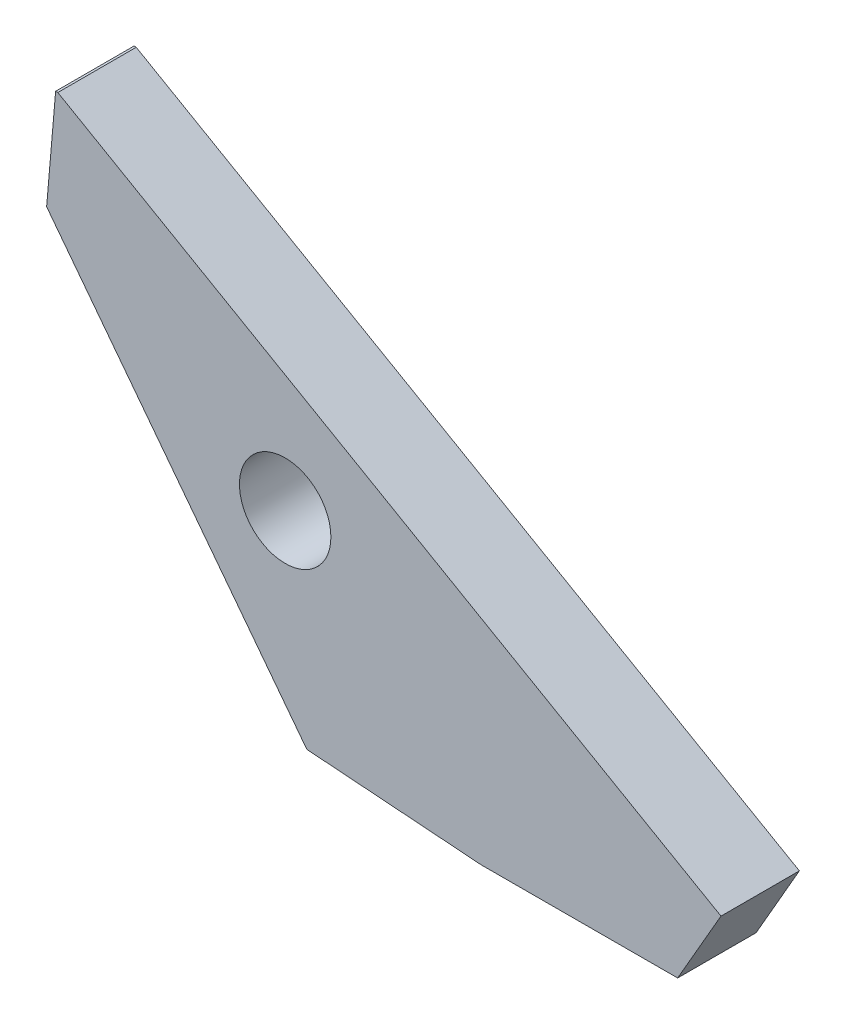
ISO-10303-21;
HEADER;
FILE_DESCRIPTION(('STEP AP214'),'2;1');
FILE_NAME('part.step','',(''),(''),'','','');
FILE_SCHEMA(('AUTOMOTIVE_DESIGN { 1 0 10303 214 1 1 1 1 }'));
ENDSEC;
DATA;
#1=APPLICATION_CONTEXT('core data for automotive mechanical design processes');
#2=APPLICATION_PROTOCOL_DEFINITION('international standard','automotive_design',2000,#1);
#3=PRODUCT_CONTEXT('',#1,'mechanical');
#4=PRODUCT('Part','Part','',(#3));
#5=PRODUCT_RELATED_PRODUCT_CATEGORY('part','',(#4));
#6=PRODUCT_DEFINITION_FORMATION('','',#4);
#7=PRODUCT_DEFINITION_CONTEXT('part definition',#1,'design');
#8=PRODUCT_DEFINITION('design','',#6,#7);
#9=PRODUCT_DEFINITION_SHAPE('','',#8);
#10=(LENGTH_UNIT() NAMED_UNIT(*) SI_UNIT(.MILLI.,.METRE.));
#11=(NAMED_UNIT(*) PLANE_ANGLE_UNIT() SI_UNIT($,.RADIAN.));
#12=(NAMED_UNIT(*) SI_UNIT($,.STERADIAN.) SOLID_ANGLE_UNIT());
#13=UNCERTAINTY_MEASURE_WITH_UNIT(LENGTH_MEASURE(1.E-05),#10,'distance_accuracy_value','');
#14=(GEOMETRIC_REPRESENTATION_CONTEXT(3) GLOBAL_UNCERTAINTY_ASSIGNED_CONTEXT((#13)) GLOBAL_UNIT_ASSIGNED_CONTEXT((#10,
#11,#12)) REPRESENTATION_CONTEXT('',''));
#15=CARTESIAN_POINT('',(0.,0.,0.));
#16=DIRECTION('',(0.,0.,1.));
#17=DIRECTION('',(1.,0.,0.));
#18=AXIS2_PLACEMENT_3D('',#15,#16,#17);
#19=CARTESIAN_POINT('',(-87.8467703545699,95.0748547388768,30.));
#20=DIRECTION('',(0.,0.,1.));
#21=DIRECTION('',(1.,0.,0.));
#22=AXIS2_PLACEMENT_3D('',#19,#20,#21);
#23=PLANE('',#22);
#24=DIRECTION('',(-1.,0.,0.));
#25=VECTOR('',#24,1.);
#26=CARTESIAN_POINT('',(-87.8467703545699,95.0748547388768,30.));
#27=LINE('',#26,#25);
#28=CARTESIAN_POINT('',(-87.0060329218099,95.0748547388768,30.));
#29=VERTEX_POINT('',#28);
#30=CARTESIAN_POINT('',(-87.8467703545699,95.0748547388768,30.));
#31=VERTEX_POINT('',#30);
#32=EDGE_CURVE('E135',#29,#31,#27,.T.);
#33=ORIENTED_EDGE('',*,*,#32,.T.);
#34=DIRECTION('',(-0.0858114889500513,-0.996311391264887,0.));
#35=VECTOR('',#34,1.);
#36=CARTESIAN_POINT('',(-90.,70.0748547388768,30.));
#37=LINE('',#36,#35);
#38=CARTESIAN_POINT('',(-91.2919377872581,55.0748547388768,30.));
#39=VERTEX_POINT('',#38);
#40=EDGE_CURVE('E88',#31,#39,#37,.T.);
#41=ORIENTED_EDGE('',*,*,#40,.T.);
#42=DIRECTION('',(0.607956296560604,-0.7939704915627,0.));
#43=VECTOR('',#42,1.);
#44=CARTESIAN_POINT('',(-91.2919377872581,55.0748547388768,30.));
#45=LINE('',#44,#43);
#46=CARTESIAN_POINT('',(8.30000000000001,-74.9888689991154,30.));
#47=VERTEX_POINT('',#46);
#48=EDGE_CURVE('E147',#39,#47,#45,.T.);
#49=ORIENTED_EDGE('',*,*,#48,.T.);
#50=DIRECTION('',(0.997301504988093,-0.0734146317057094,0.));
#51=VECTOR('',#50,1.);
#52=CARTESIAN_POINT('',(8.30000000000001,-74.9888689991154,30.));
#53=LINE('',#52,#51);
#54=CARTESIAN_POINT('',(75.,-79.898874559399,30.));
#55=VERTEX_POINT('',#54);
#56=EDGE_CURVE('E104',#47,#55,#53,.T.);
#57=ORIENTED_EDGE('',*,*,#56,.T.);
#58=DIRECTION('',(0.999999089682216,0.0013493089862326,0.));
#59=VECTOR('',#58,1.);
#60=CARTESIAN_POINT('',(150.218878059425,-79.7973809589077,30.));
#61=LINE('',#60,#59);
#62=CARTESIAN_POINT('',(150.218878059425,-79.7973809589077,30.));
#63=VERTEX_POINT('',#62);
#64=EDGE_CURVE('E98',#55,#63,#61,.T.);
#65=ORIENTED_EDGE('',*,*,#64,.T.);
#66=DIRECTION('',(0.498831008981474,0.866699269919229,0.));
#67=VECTOR('',#66,1.);
#68=CARTESIAN_POINT('',(166.793285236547,-51.,30.));
#69=LINE('',#68,#67);
#70=CARTESIAN_POINT('',(166.793285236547,-51.,30.));
#71=VERTEX_POINT('',#70);
#72=EDGE_CURVE('E102',#63,#71,#69,.T.);
#73=ORIENTED_EDGE('',*,*,#72,.T.);
#74=DIRECTION('',(-0.866699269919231,0.49883100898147,0.));
#75=VECTOR('',#74,1.);
#76=CARTESIAN_POINT('',(-87.0060329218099,95.0748547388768,30.));
#77=LINE('',#76,#75);
#78=EDGE_CURVE('E48',#71,#29,#77,.T.);
#79=ORIENTED_EDGE('',*,*,#78,.T.);
#80=EDGE_LOOP('',(#33,#41,#49,#57,#65,#73,#79));
#81=FACE_BOUND('',#80,.T.);
#82=CARTESIAN_POINT('',(0.,0.,30.));
#83=DIRECTION('',(0.,0.,1.));
#84=DIRECTION('',(1.,0.,0.));
#85=AXIS2_PLACEMENT_3D('',#82,#83,#84);
#86=CIRCLE('',#85,17.5);
#87=CARTESIAN_POINT('',(17.5,0.,30.));
#88=VERTEX_POINT('',#87);
#89=EDGE_CURVE('E126',#88,#88,#86,.T.);
#90=ORIENTED_EDGE('',*,*,#89,.F.);
#91=EDGE_LOOP('',(#90));
#92=FACE_BOUND('',#91,.T.);
#93=ADVANCED_FACE('F31',(#81,#92),#23,.T.);
#94=CARTESIAN_POINT('',(-87.8467703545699,95.0748547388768,0.));
#95=DIRECTION('',(0.,0.,1.));
#96=DIRECTION('',(1.,0.,0.));
#97=AXIS2_PLACEMENT_3D('',#94,#95,#96);
#98=PLANE('',#97);
#99=DIRECTION('',(-1.,0.,0.));
#100=VECTOR('',#99,1.);
#101=CARTESIAN_POINT('',(-87.8467703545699,95.0748547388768,0.));
#102=LINE('',#101,#100);
#103=CARTESIAN_POINT('',(-87.0060329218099,95.0748547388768,0.));
#104=VERTEX_POINT('',#103);
#105=CARTESIAN_POINT('',(-87.8467703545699,95.0748547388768,0.));
#106=VERTEX_POINT('',#105);
#107=EDGE_CURVE('E122',#104,#106,#102,.T.);
#108=ORIENTED_EDGE('',*,*,#107,.F.);
#109=DIRECTION('',(-0.866699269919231,0.49883100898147,0.));
#110=VECTOR('',#109,1.);
#111=CARTESIAN_POINT('',(-87.0060329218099,95.0748547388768,0.));
#112=LINE('',#111,#110);
#113=CARTESIAN_POINT('',(166.793285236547,-51.,0.));
#114=VERTEX_POINT('',#113);
#115=EDGE_CURVE('E80',#114,#104,#112,.T.);
#116=ORIENTED_EDGE('',*,*,#115,.F.);
#117=DIRECTION('',(0.498831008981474,0.866699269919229,0.));
#118=VECTOR('',#117,1.);
#119=CARTESIAN_POINT('',(166.793285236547,-51.,0.));
#120=LINE('',#119,#118);
#121=CARTESIAN_POINT('',(150.218878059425,-79.7973809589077,0.));
#122=VERTEX_POINT('',#121);
#123=EDGE_CURVE('E74',#122,#114,#120,.T.);
#124=ORIENTED_EDGE('',*,*,#123,.F.);
#125=DIRECTION('',(0.999999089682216,0.0013493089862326,0.));
#126=VECTOR('',#125,1.);
#127=CARTESIAN_POINT('',(150.218878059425,-79.7973809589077,0.));
#128=LINE('',#127,#126);
#129=CARTESIAN_POINT('',(75.,-79.898874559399,0.));
#130=VERTEX_POINT('',#129);
#131=EDGE_CURVE('E112',#130,#122,#128,.T.);
#132=ORIENTED_EDGE('',*,*,#131,.F.);
#133=DIRECTION('',(0.997301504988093,-0.0734146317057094,0.));
#134=VECTOR('',#133,1.);
#135=CARTESIAN_POINT('',(8.30000000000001,-74.9888689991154,0.));
#136=LINE('',#135,#134);
#137=CARTESIAN_POINT('',(8.30000000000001,-74.9888689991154,0.));
#138=VERTEX_POINT('',#137);
#139=EDGE_CURVE('E130',#138,#130,#136,.T.);
#140=ORIENTED_EDGE('',*,*,#139,.F.);
#141=DIRECTION('',(0.607956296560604,-0.7939704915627,0.));
#142=VECTOR('',#141,1.);
#143=CARTESIAN_POINT('',(-91.2919377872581,55.0748547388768,0.));
#144=LINE('',#143,#142);
#145=CARTESIAN_POINT('',(-91.2919377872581,55.0748547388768,0.));
#146=VERTEX_POINT('',#145);
#147=EDGE_CURVE('E128',#146,#138,#144,.T.);
#148=ORIENTED_EDGE('',*,*,#147,.F.);
#149=DIRECTION('',(-0.0858114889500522,-0.996311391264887,0.));
#150=VECTOR('',#149,1.);
#151=CARTESIAN_POINT('',(-91.2919377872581,55.0748547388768,0.));
#152=LINE('',#151,#150);
#153=EDGE_CURVE('E125',#106,#146,#152,.T.);
#154=ORIENTED_EDGE('',*,*,#153,.F.);
#155=EDGE_LOOP('',(#108,#116,#124,#132,#140,#148,#154));
#156=FACE_BOUND('',#155,.T.);
#157=CARTESIAN_POINT('',(0.,0.,0.));
#158=DIRECTION('',(0.,0.,1.));
#159=DIRECTION('',(1.,0.,0.));
#160=AXIS2_PLACEMENT_3D('',#157,#158,#159);
#161=CIRCLE('',#160,17.5);
#162=CARTESIAN_POINT('',(17.5,0.,0.));
#163=VERTEX_POINT('',#162);
#164=EDGE_CURVE('E159',#163,#163,#161,.T.);
#165=ORIENTED_EDGE('',*,*,#164,.T.);
#166=EDGE_LOOP('',(#165));
#167=FACE_BOUND('',#166,.T.);
#168=ADVANCED_FACE('F151',(#156,#167),#98,.F.);
#169=CARTESIAN_POINT('',(-87.8467703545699,95.0748547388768,30.));
#170=DIRECTION('',(0.,-1.,0.));
#171=DIRECTION('',(0.,0.,-1.));
#172=AXIS2_PLACEMENT_3D('',#169,#170,#171);
#173=PLANE('',#172);
#174=ORIENTED_EDGE('',*,*,#107,.T.);
#175=DIRECTION('',(0.,0.,-1.));
#176=VECTOR('',#175,1.);
#177=CARTESIAN_POINT('',(-87.8467703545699,95.0748547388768,30.));
#178=LINE('',#177,#176);
#179=EDGE_CURVE('E11',#31,#106,#178,.T.);
#180=ORIENTED_EDGE('',*,*,#179,.F.);
#181=ORIENTED_EDGE('',*,*,#32,.F.);
#182=DIRECTION('',(0.,0.,-1.));
#183=VECTOR('',#182,1.);
#184=CARTESIAN_POINT('',(-87.0060329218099,95.0748547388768,30.));
#185=LINE('',#184,#183);
#186=EDGE_CURVE('E118',#29,#104,#185,.T.);
#187=ORIENTED_EDGE('',*,*,#186,.T.);
#188=EDGE_LOOP('',(#174,#180,#181,#187));
#189=FACE_BOUND('',#188,.T.);
#190=ADVANCED_FACE('F33',(#189),#173,.F.);
#191=CARTESIAN_POINT('',(-91.2919377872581,55.0748547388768,30.));
#192=DIRECTION('',(0.996311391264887,-0.0858114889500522,0.));
#193=DIRECTION('',(0.0858114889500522,0.996311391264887,0.));
#194=AXIS2_PLACEMENT_3D('',#191,#192,#193);
#195=PLANE('',#194);
#196=ORIENTED_EDGE('',*,*,#153,.T.);
#197=DIRECTION('',(0.,0.,-1.));
#198=VECTOR('',#197,1.);
#199=CARTESIAN_POINT('',(-91.2919377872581,55.0748547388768,30.));
#200=LINE('',#199,#198);
#201=EDGE_CURVE('E40',#39,#146,#200,.T.);
#202=ORIENTED_EDGE('',*,*,#201,.F.);
#203=ORIENTED_EDGE('',*,*,#40,.F.);
#204=ORIENTED_EDGE('',*,*,#179,.T.);
#205=EDGE_LOOP('',(#196,#202,#203,#204));
#206=FACE_BOUND('',#205,.T.);
#207=ADVANCED_FACE('F185',(#206),#195,.F.);
#208=CARTESIAN_POINT('',(-91.2919377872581,55.0748547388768,30.));
#209=DIRECTION('',(0.7939704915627,0.607956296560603,0.));
#210=DIRECTION('',(-0.607956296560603,0.7939704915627,0.));
#211=AXIS2_PLACEMENT_3D('',#208,#209,#210);
#212=PLANE('',#211);
#213=ORIENTED_EDGE('',*,*,#147,.T.);
#214=DIRECTION('',(0.,0.,-1.));
#215=VECTOR('',#214,1.);
#216=CARTESIAN_POINT('',(8.30000000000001,-74.9888689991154,30.));
#217=LINE('',#216,#215);
#218=EDGE_CURVE('E139',#47,#138,#217,.T.);
#219=ORIENTED_EDGE('',*,*,#218,.F.);
#220=ORIENTED_EDGE('',*,*,#48,.F.);
#221=ORIENTED_EDGE('',*,*,#201,.T.);
#222=EDGE_LOOP('',(#213,#219,#220,#221));
#223=FACE_BOUND('',#222,.T.);
#224=ADVANCED_FACE('F145',(#223),#212,.F.);
#225=CARTESIAN_POINT('',(8.30000000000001,-74.9888689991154,30.));
#226=DIRECTION('',(0.0734146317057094,0.997301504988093,0.));
#227=DIRECTION('',(-0.997301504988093,0.0734146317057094,0.));
#228=AXIS2_PLACEMENT_3D('',#225,#226,#227);
#229=PLANE('',#228);
#230=ORIENTED_EDGE('',*,*,#139,.T.);
#231=DIRECTION('',(0.,0.,-1.));
#232=VECTOR('',#231,1.);
#233=CARTESIAN_POINT('',(75.,-79.898874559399,30.));
#234=LINE('',#233,#232);
#235=EDGE_CURVE('E113',#55,#130,#234,.T.);
#236=ORIENTED_EDGE('',*,*,#235,.F.);
#237=ORIENTED_EDGE('',*,*,#56,.F.);
#238=ORIENTED_EDGE('',*,*,#218,.T.);
#239=EDGE_LOOP('',(#230,#236,#237,#238));
#240=FACE_BOUND('',#239,.T.);
#241=ADVANCED_FACE('F154',(#240),#229,.F.);
#242=CARTESIAN_POINT('',(150.218878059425,-79.7973809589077,30.));
#243=DIRECTION('',(-0.0013493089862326,0.999999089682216,0.));
#244=DIRECTION('',(-0.999999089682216,-0.0013493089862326,0.));
#245=AXIS2_PLACEMENT_3D('',#242,#243,#244);
#246=PLANE('',#245);
#247=ORIENTED_EDGE('',*,*,#131,.T.);
#248=DIRECTION('',(0.,0.,-1.));
#249=VECTOR('',#248,1.);
#250=CARTESIAN_POINT('',(150.218878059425,-79.7973809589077,30.));
#251=LINE('',#250,#249);
#252=EDGE_CURVE('E109',#63,#122,#251,.T.);
#253=ORIENTED_EDGE('',*,*,#252,.F.);
#254=ORIENTED_EDGE('',*,*,#64,.F.);
#255=ORIENTED_EDGE('',*,*,#235,.T.);
#256=EDGE_LOOP('',(#247,#253,#254,#255));
#257=FACE_BOUND('',#256,.T.);
#258=ADVANCED_FACE('F110',(#257),#246,.F.);
#259=CARTESIAN_POINT('',(166.793285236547,-51.,30.));
#260=DIRECTION('',(-0.866699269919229,0.498831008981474,0.));
#261=DIRECTION('',(-0.498831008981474,-0.866699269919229,0.));
#262=AXIS2_PLACEMENT_3D('',#259,#260,#261);
#263=PLANE('',#262);
#264=ORIENTED_EDGE('',*,*,#123,.T.);
#265=DIRECTION('',(0.,0.,-1.));
#266=VECTOR('',#265,1.);
#267=CARTESIAN_POINT('',(166.793285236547,-51.,30.));
#268=LINE('',#267,#266);
#269=EDGE_CURVE('E114',#71,#114,#268,.T.);
#270=ORIENTED_EDGE('',*,*,#269,.F.);
#271=ORIENTED_EDGE('',*,*,#72,.F.);
#272=ORIENTED_EDGE('',*,*,#252,.T.);
#273=EDGE_LOOP('',(#264,#270,#271,#272));
#274=FACE_BOUND('',#273,.T.);
#275=ADVANCED_FACE('F116',(#274),#263,.F.);
#276=CARTESIAN_POINT('',(-87.0060329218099,95.0748547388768,30.));
#277=DIRECTION('',(-0.49883100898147,-0.866699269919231,0.));
#278=DIRECTION('',(0.866699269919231,-0.49883100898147,0.));
#279=AXIS2_PLACEMENT_3D('',#276,#277,#278);
#280=PLANE('',#279);
#281=ORIENTED_EDGE('',*,*,#115,.T.);
#282=ORIENTED_EDGE('',*,*,#186,.F.);
#283=ORIENTED_EDGE('',*,*,#78,.F.);
#284=ORIENTED_EDGE('',*,*,#269,.T.);
#285=EDGE_LOOP('',(#281,#282,#283,#284));
#286=FACE_BOUND('',#285,.T.);
#287=ADVANCED_FACE('F175',(#286),#280,.F.);
#288=CARTESIAN_POINT('',(0.,0.,30.));
#289=DIRECTION('',(0.,0.,-1.));
#290=DIRECTION('',(-1.,0.,0.));
#291=AXIS2_PLACEMENT_3D('',#288,#289,#290);
#292=CYLINDRICAL_SURFACE('',#291,17.5);
#293=ORIENTED_EDGE('',*,*,#89,.T.);
#294=EDGE_LOOP('',(#293));
#295=FACE_BOUND('',#294,.T.);
#296=ORIENTED_EDGE('',*,*,#164,.F.);
#297=EDGE_LOOP('',(#296));
#298=FACE_BOUND('',#297,.T.);
#299=ADVANCED_FACE('F165',(#295,#298),#292,.F.);
#300=CLOSED_SHELL('',(#93,#168,#190,#207,#224,#241,#258,#275,#287,#299));
#301=MANIFOLD_SOLID_BREP('B2',#300);
#302=ADVANCED_BREP_SHAPE_REPRESENTATION('',(#18,#301),#14);
#303=SHAPE_DEFINITION_REPRESENTATION(#9,#302);
ENDSEC;
END-ISO-10303-21;
